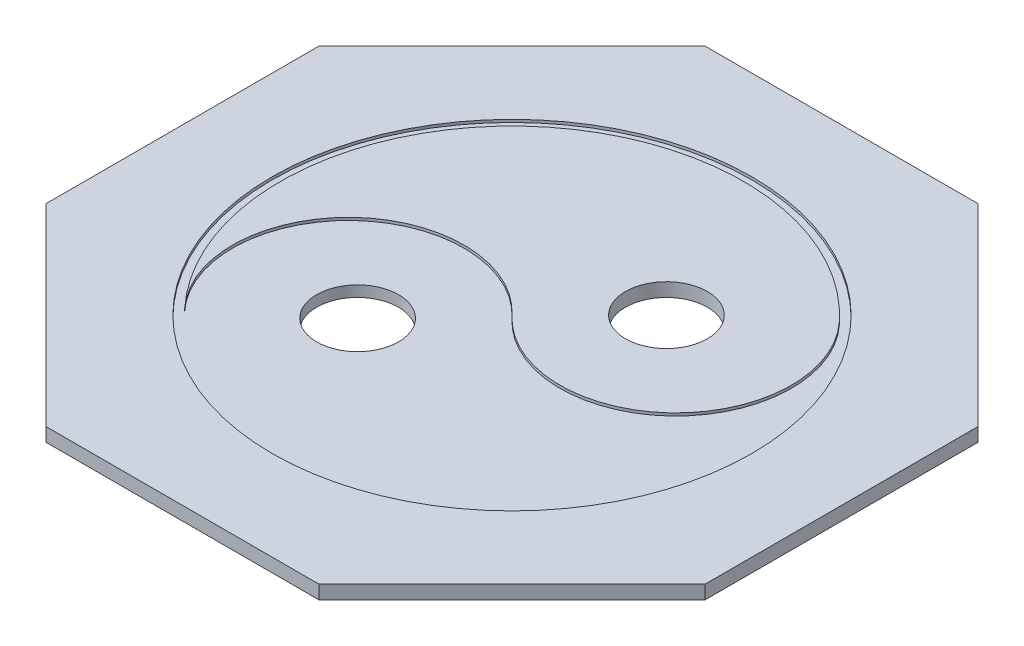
from build123d import *

# Parameters (mm, degrees)
CROQUIS1_R              = 15
SALIENTE_EXTRUIR1_DEPTH = 5
CORTAR_EXTRUIR1_START   = -1
CROQUIS2_R              = 87.848684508
CROQUIS2_R_2            = 15
CORTAR_EXTRUIR1_DEPTH   = 1


with BuildPart() as part:
    # Croquis1 → Saliente-Extruir1 (new body)
    with BuildSketch(Plane(origin=(0, 0, 0), x_dir=(1, 0, 0), z_dir=(0, 1, 0))):
        Polygon((1.605142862, -84.379521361), (101.605142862, -84.379521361), (172.315820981, -13.668843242), (172.315820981, 86.331156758), (101.605142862, 157.041834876), (1.605142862, 157.041834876), (-69.105535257, 86.331156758), (-69.105535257, -13.668843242), align=None)
        with Locations(Location((23.320871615, 8.04688551, 0), (0, 0, 270))):
            Circle(CROQUIS1_R, mode=Mode.SUBTRACT)
        with Locations(Location((79.889414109, 64.615428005, 0), (0, 0, 90))):
            Circle(CROQUIS1_R, mode=Mode.SUBTRACT)
    extrude(amount=SALIENTE_EXTRUIR1_DEPTH)

    # Croquis2 → Cortar-Extruir1 (cut)
    with BuildSketch(Plane(origin=(0, 5, 0), x_dir=(1, 0, 0), z_dir=(0, 1, 0)).offset(CORTAR_EXTRUIR1_START)):
        with Locations(Location((51.605142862, 36.331156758, 0), (0, 0, 270))):
            Circle(CROQUIS2_R)
        with Locations(Location((23.320871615, 8.04688551, 0), (0, 0, 270))):
            Circle(CROQUIS2_R_2, mode=Mode.SUBTRACT)
        with BuildLine():
            ThreePointArc((51.605142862, 36.331156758), (111.566635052, 34.264980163), (113.632811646, 94.226472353))
            ThreePointArc((113.632811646, 94.226472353), (-6.290172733, 98.358825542), (-10.422525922, -21.564158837))
            ThreePointArc((-10.422525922, -21.564158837), (-8.356349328, 38.397333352), (51.605142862, 36.331156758))
        make_face(mode=Mode.SUBTRACT)
    extrude(amount=CORTAR_EXTRUIR1_DEPTH, mode=Mode.SUBTRACT)


solid = part.part
